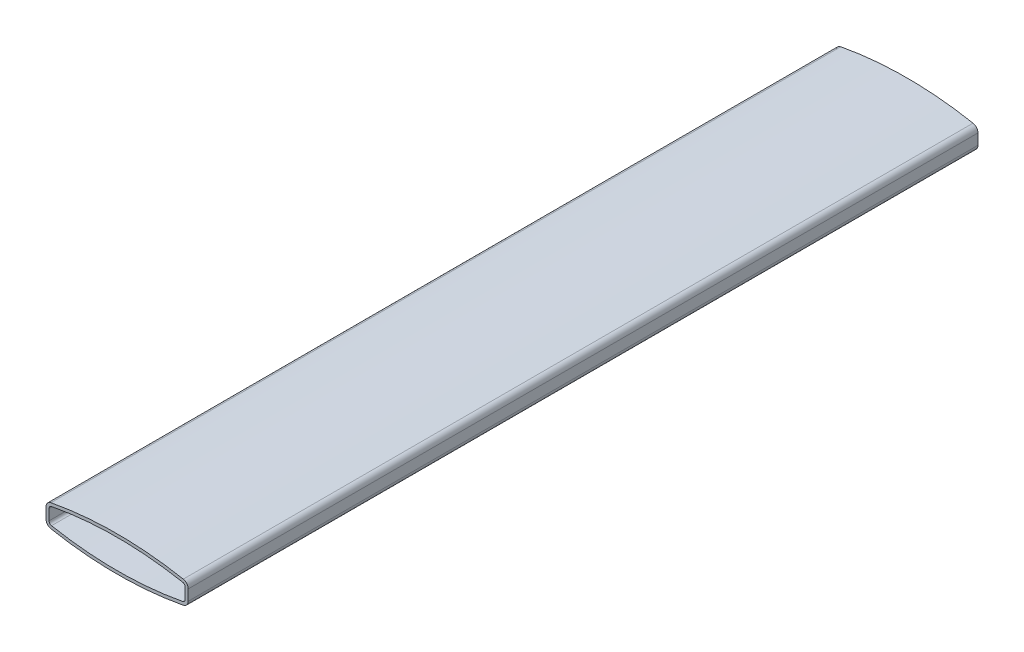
from build123d import *

# Parameters (mm, degrees)
BOSS_EXTRUDE1_DEPTH = 388.65
FILLET1_R           = 3
SHELL1_T            = -1.5


with BuildPart() as part:
    # Sketch1 → Boss-Extrude1 (new body)
    with BuildSketch(Plane.XY):
        with BuildLine():
            Line((-35, 0), (-35, -5.089281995))
            ThreePointArc((-35, -5.089281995), (0, -8.625), (35, -5.089281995))
            Line((35, -5.089281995), (35, 0))
            Line((35, 0), (35, 5.089281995))
            ThreePointArc((35, 5.089281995), (0, 8.625), (-35, 5.089281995))
            Line((-35, 5.089281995), (-35, 0))
        make_face()
    extrude(amount=BOSS_EXTRUDE1_DEPTH)

    # Fillet1
    fillet1_edges = [part.edges().sort_by_distance(p)[0] for p in [
        (-35, 5.089281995, 194.325),
        (35, 5.089281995, 194.325),
        (35, -5.089281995, 194.325),
        (-35, -5.089281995, 194.325),
    ]]
    fillet(fillet1_edges, radius=FILLET1_R)

    # Shell1
    shell1_openings = [part.faces().sort_by_distance(p)[0] for p in [
        (0, 0, 388.65),
        (0, 0, 0),
    ]]
    offset(amount=SHELL1_T, openings=shell1_openings, kind=Kind.INTERSECTION)


solid = part.part
